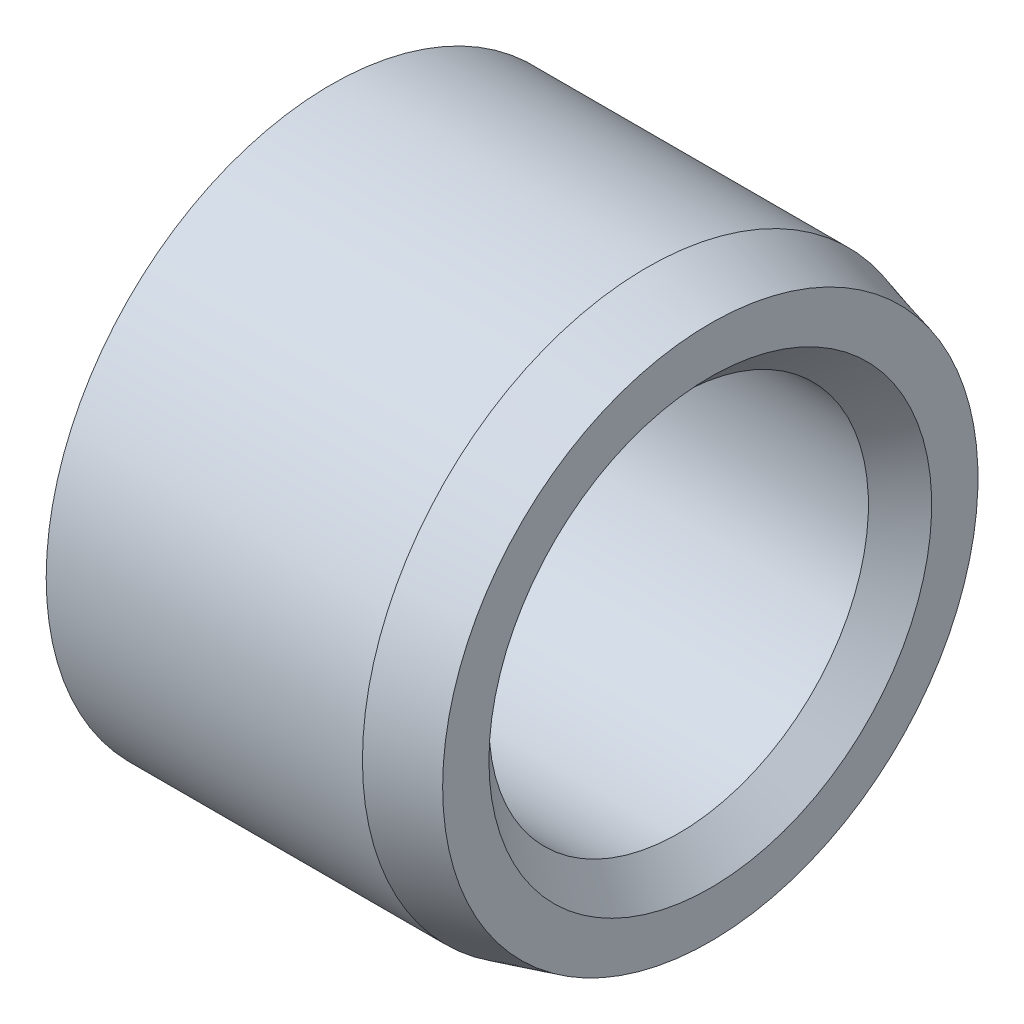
from build123d import *


with BuildPart() as part:
    # Esquisse1 → R_volution1 (revolve)
    with BuildSketch(Plane(origin=(0, 0, 0), x_dir=(-1, 0, 0), z_dir=(0, 0, -1)), mode=Mode.PRIVATE) as r_volution1_sk:
        Polygon((-3, 2.116025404), (-3, 1.75), (-2.75, 1.5), (-0.3, 1.5), (0, 1.8), (0, 2.25), (-2.5, 2.25), align=None)
    revolve(r_volution1_sk.sketch.rotate(Axis((3, 0, 0), (-1, 0, 0)), 270), axis=Axis((3, 0, 0), (-1, 0, 0)))


solid = part.part
